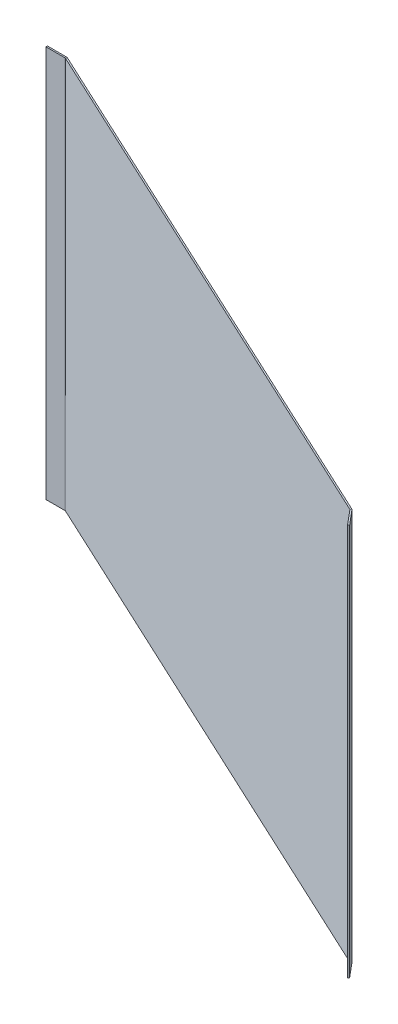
ISO-10303-21;
HEADER;
FILE_DESCRIPTION(('STEP AP214'),'2;1');
FILE_NAME('part.step','',(''),(''),'','','');
FILE_SCHEMA(('AUTOMOTIVE_DESIGN { 1 0 10303 214 1 1 1 1 }'));
ENDSEC;
DATA;
#1=APPLICATION_CONTEXT('core data for automotive mechanical design processes');
#2=APPLICATION_PROTOCOL_DEFINITION('international standard','automotive_design',2000,#1);
#3=PRODUCT_CONTEXT('',#1,'mechanical');
#4=PRODUCT('Part','Part','',(#3));
#5=PRODUCT_RELATED_PRODUCT_CATEGORY('part','',(#4));
#6=PRODUCT_DEFINITION_FORMATION('','',#4);
#7=PRODUCT_DEFINITION_CONTEXT('part definition',#1,'design');
#8=PRODUCT_DEFINITION('design','',#6,#7);
#9=PRODUCT_DEFINITION_SHAPE('','',#8);
#10=(LENGTH_UNIT() NAMED_UNIT(*) SI_UNIT(.MILLI.,.METRE.));
#11=(NAMED_UNIT(*) PLANE_ANGLE_UNIT() SI_UNIT($,.RADIAN.));
#12=(NAMED_UNIT(*) SI_UNIT($,.STERADIAN.) SOLID_ANGLE_UNIT());
#13=UNCERTAINTY_MEASURE_WITH_UNIT(LENGTH_MEASURE(1.E-05),#10,'distance_accuracy_value','');
#14=(GEOMETRIC_REPRESENTATION_CONTEXT(3) GLOBAL_UNCERTAINTY_ASSIGNED_CONTEXT((#13)) GLOBAL_UNIT_ASSIGNED_CONTEXT((#10,
#11,#12)) REPRESENTATION_CONTEXT('',''));
#15=CARTESIAN_POINT('',(0.,0.,0.));
#16=DIRECTION('',(0.,0.,1.));
#17=DIRECTION('',(1.,0.,0.));
#18=AXIS2_PLACEMENT_3D('',#15,#16,#17);
#19=CARTESIAN_POINT('',(4.56848885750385,800.,-16.5205923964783));
#20=DIRECTION('',(0.4226182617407,0.,-0.90630778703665));
#21=DIRECTION('',(-0.90630778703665,0.,-0.4226182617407));
#22=AXIS2_PLACEMENT_3D('',#19,#20,#21);
#23=PLANE('',#22);
#24=DIRECTION('',(-0.90630778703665,0.,-0.4226182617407));
#25=VECTOR('',#24,1.);
#26=CARTESIAN_POINT('',(4.56848885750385,800.,-16.5205923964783));
#27=LINE('',#26,#25);
#28=CARTESIAN_POINT('',(1128.39014478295,800.,507.52605216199));
#29=VERTEX_POINT('',#28);
#30=CARTESIAN_POINT('',(40.8208003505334,800.,0.384138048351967));
#31=VERTEX_POINT('',#30);
#32=EDGE_CURVE('E60',#29,#31,#27,.T.);
#33=ORIENTED_EDGE('',*,*,#32,.F.);
#34=DIRECTION('',(0.,-1.,0.));
#35=VECTOR('',#34,1.);
#36=CARTESIAN_POINT('',(1128.39014478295,800.,507.52605216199));
#37=LINE('',#36,#35);
#38=CARTESIAN_POINT('',(1128.39014478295,0.,507.52605216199));
#39=VERTEX_POINT('',#38);
#40=EDGE_CURVE('E52',#29,#39,#37,.T.);
#41=ORIENTED_EDGE('',*,*,#40,.T.);
#42=DIRECTION('',(0.90630778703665,0.,0.4226182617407));
#43=VECTOR('',#42,1.);
#44=CARTESIAN_POINT('',(4.56848885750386,0.,-16.5205923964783));
#45=LINE('',#44,#43);
#46=CARTESIAN_POINT('',(40.8208003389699,0.,0.384138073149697));
#47=VERTEX_POINT('',#46);
#48=EDGE_CURVE('E68',#47,#39,#45,.T.);
#49=ORIENTED_EDGE('',*,*,#48,.F.);
#50=DIRECTION('',(0.,-1.,0.));
#51=VECTOR('',#50,1.);
#52=CARTESIAN_POINT('',(40.8208003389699,800.,0.384138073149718));
#53=LINE('',#52,#51);
#54=EDGE_CURVE('E229',#31,#47,#53,.T.);
#55=ORIENTED_EDGE('',*,*,#54,.F.);
#56=EDGE_LOOP('',(#33,#41,#49,#55));
#57=FACE_BOUND('',#56,.T.);
#58=ADVANCED_FACE('F43',(#57),#23,.T.);
#59=CARTESIAN_POINT('',(3.30063407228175,800.,-13.8016690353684));
#60=DIRECTION('',(0.4226182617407,0.,-0.90630778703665));
#61=DIRECTION('',(-0.90630778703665,0.,-0.4226182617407));
#62=AXIS2_PLACEMENT_3D('',#59,#60,#61);
#63=PLANE('',#62);
#64=DIRECTION('',(0.,-1.,0.));
#65=VECTOR('',#64,1.);
#66=CARTESIAN_POINT('',(1127.12228999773,800.,510.2449755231));
#67=LINE('',#66,#65);
#68=CARTESIAN_POINT('',(1127.12229034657,800.,510.244974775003));
#69=VERTEX_POINT('',#68);
#70=CARTESIAN_POINT('',(1127.12228999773,0.,510.2449755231));
#71=VERTEX_POINT('',#70);
#72=EDGE_CURVE('E233',#69,#71,#67,.T.);
#73=ORIENTED_EDGE('',*,*,#72,.F.);
#74=DIRECTION('',(-0.90630778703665,0.,-0.4226182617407));
#75=VECTOR('',#74,1.);
#76=CARTESIAN_POINT('',(3.30063407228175,800.,-13.8016690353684));
#77=LINE('',#76,#75);
#78=CARTESIAN_POINT('',(39.5529455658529,800.,3.10306140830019));
#79=VERTEX_POINT('',#78);
#80=EDGE_CURVE('E47',#69,#79,#77,.T.);
#81=ORIENTED_EDGE('',*,*,#80,.T.);
#82=DIRECTION('',(0.,-1.,0.));
#83=VECTOR('',#82,1.);
#84=CARTESIAN_POINT('',(39.5529455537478,800.,3.10306143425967));
#85=LINE('',#84,#83);
#86=CARTESIAN_POINT('',(39.552945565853,0.,3.10306140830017));
#87=VERTEX_POINT('',#86);
#88=EDGE_CURVE('E223',#79,#87,#85,.T.);
#89=ORIENTED_EDGE('',*,*,#88,.T.);
#90=DIRECTION('',(0.90630778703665,0.,0.4226182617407));
#91=VECTOR('',#90,1.);
#92=CARTESIAN_POINT('',(3.30063407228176,0.,-13.8016690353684));
#93=LINE('',#92,#91);
#94=EDGE_CURVE('E241',#87,#71,#93,.T.);
#95=ORIENTED_EDGE('',*,*,#94,.T.);
#96=EDGE_LOOP('',(#73,#81,#89,#95));
#97=FACE_BOUND('',#96,.T.);
#98=ADVANCED_FACE('F246',(#97),#63,.F.);
#99=CARTESIAN_POINT('',(3.30063407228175,800.,-13.8016690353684));
#100=DIRECTION('',(0.,-1.,0.));
#101=DIRECTION('',(0.4226182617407,0.,-0.90630778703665));
#102=AXIS2_PLACEMENT_3D('',#99,#100,#101);
#103=PLANE('',#102);
#104=DIRECTION('',(-0.4226182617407,0.,0.90630778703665));
#105=VECTOR('',#104,1.);
#106=CARTESIAN_POINT('',(1127.12228999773,800.,510.2449755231));
#107=LINE('',#106,#105);
#108=EDGE_CURVE('E12',#29,#69,#107,.T.);
#109=ORIENTED_EDGE('',*,*,#108,.F.);
#110=ORIENTED_EDGE('',*,*,#32,.T.);
#111=DIRECTION('',(-0.4226182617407,0.,0.90630778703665));
#112=VECTOR('',#111,1.);
#113=CARTESIAN_POINT('',(39.5529455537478,800.,3.10306143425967));
#114=LINE('',#113,#112);
#115=EDGE_CURVE('E226',#31,#79,#114,.T.);
#116=ORIENTED_EDGE('',*,*,#115,.T.);
#117=ORIENTED_EDGE('',*,*,#80,.F.);
#118=EDGE_LOOP('',(#109,#110,#116,#117));
#119=FACE_BOUND('',#118,.T.);
#120=ADVANCED_FACE('F45',(#119),#103,.F.);
#121=CARTESIAN_POINT('',(3.30063407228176,0.,-13.8016690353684));
#122=DIRECTION('',(0.,1.,0.));
#123=DIRECTION('',(-0.4226182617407,0.,0.90630778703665));
#124=AXIS2_PLACEMENT_3D('',#121,#122,#123);
#125=PLANE('',#124);
#126=DIRECTION('',(0.4226182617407,0.,-0.90630778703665));
#127=VECTOR('',#126,1.);
#128=CARTESIAN_POINT('',(1127.12228999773,0.,510.2449755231));
#129=LINE('',#128,#127);
#130=EDGE_CURVE('E236',#71,#39,#129,.T.);
#131=ORIENTED_EDGE('',*,*,#130,.F.);
#132=ORIENTED_EDGE('',*,*,#94,.F.);
#133=DIRECTION('',(0.4226182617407,0.,-0.90630778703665));
#134=VECTOR('',#133,1.);
#135=CARTESIAN_POINT('',(39.5529455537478,0.,3.10306143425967));
#136=LINE('',#135,#134);
#137=EDGE_CURVE('E231',#87,#47,#136,.T.);
#138=ORIENTED_EDGE('',*,*,#137,.T.);
#139=ORIENTED_EDGE('',*,*,#48,.T.);
#140=EDGE_LOOP('',(#131,#132,#138,#139));
#141=FACE_BOUND('',#140,.T.);
#142=ADVANCED_FACE('F279',(#141),#125,.F.);
#143=CARTESIAN_POINT('',(0.,0.,3.));
#144=DIRECTION('',(1.,0.,0.));
#145=DIRECTION('',(0.,0.,-1.));
#146=AXIS2_PLACEMENT_3D('',#143,#144,#145);
#147=PLANE('',#146);
#148=DIRECTION('',(0.,-1.,0.));
#149=VECTOR('',#148,1.);
#150=CARTESIAN_POINT('',(0.,0.,0.));
#151=LINE('',#150,#149);
#152=CARTESIAN_POINT('',(0.,800.,0.));
#153=VERTEX_POINT('',#152);
#154=CARTESIAN_POINT('',(0.,0.,0.));
#155=VERTEX_POINT('',#154);
#156=EDGE_CURVE('E212',#153,#155,#151,.T.);
#157=ORIENTED_EDGE('',*,*,#156,.T.);
#158=DIRECTION('',(0.,0.,-1.));
#159=VECTOR('',#158,1.);
#160=CARTESIAN_POINT('',(0.,0.,3.));
#161=LINE('',#160,#159);
#162=CARTESIAN_POINT('',(0.,0.,3.));
#163=VERTEX_POINT('',#162);
#164=EDGE_CURVE('E194',#163,#155,#161,.T.);
#165=ORIENTED_EDGE('',*,*,#164,.F.);
#166=DIRECTION('',(0.,-1.,0.));
#167=VECTOR('',#166,1.);
#168=CARTESIAN_POINT('',(0.,0.,3.));
#169=LINE('',#168,#167);
#170=CARTESIAN_POINT('',(0.,800.,3.));
#171=VERTEX_POINT('',#170);
#172=EDGE_CURVE('E204',#171,#163,#169,.T.);
#173=ORIENTED_EDGE('',*,*,#172,.F.);
#174=DIRECTION('',(0.,0.,-1.));
#175=VECTOR('',#174,1.);
#176=CARTESIAN_POINT('',(0.,800.,3.));
#177=LINE('',#176,#175);
#178=EDGE_CURVE('E209',#171,#153,#177,.T.);
#179=ORIENTED_EDGE('',*,*,#178,.T.);
#180=EDGE_LOOP('',(#157,#165,#173,#179));
#181=FACE_BOUND('',#180,.T.);
#182=ADVANCED_FACE('F277',(#181),#147,.F.);
#183=CARTESIAN_POINT('',(0.,800.,3.));
#184=DIRECTION('',(0.,0.,-1.));
#185=DIRECTION('',(-1.,0.,0.));
#186=AXIS2_PLACEMENT_3D('',#183,#184,#185);
#187=PLANE('',#186);
#188=DIRECTION('',(0.,-1.,0.));
#189=VECTOR('',#188,1.);
#190=CARTESIAN_POINT('',(39.088065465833,800.,3.));
#191=LINE('',#190,#189);
#192=CARTESIAN_POINT('',(39.088065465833,800.,2.9999999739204));
#193=VERTEX_POINT('',#192);
#194=CARTESIAN_POINT('',(39.088065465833,0.,3.));
#195=VERTEX_POINT('',#194);
#196=EDGE_CURVE('E191',#193,#195,#191,.T.);
#197=ORIENTED_EDGE('',*,*,#196,.F.);
#198=DIRECTION('',(-1.,0.,0.));
#199=VECTOR('',#198,1.);
#200=CARTESIAN_POINT('',(0.,800.,3.));
#201=LINE('',#200,#199);
#202=EDGE_CURVE('E207',#193,#171,#201,.T.);
#203=ORIENTED_EDGE('',*,*,#202,.T.);
#204=ORIENTED_EDGE('',*,*,#172,.T.);
#205=DIRECTION('',(1.,0.,0.));
#206=VECTOR('',#205,1.);
#207=CARTESIAN_POINT('',(0.,0.,3.));
#208=LINE('',#207,#206);
#209=EDGE_CURVE('E202',#163,#195,#208,.T.);
#210=ORIENTED_EDGE('',*,*,#209,.T.);
#211=EDGE_LOOP('',(#197,#203,#204,#210));
#212=FACE_BOUND('',#211,.T.);
#213=ADVANCED_FACE('F270',(#212),#187,.F.);
#214=CARTESIAN_POINT('',(0.,800.,3.));
#215=DIRECTION('',(0.,-1.,0.));
#216=DIRECTION('',(0.,0.,-1.));
#217=AXIS2_PLACEMENT_3D('',#214,#215,#216);
#218=PLANE('',#217);
#219=DIRECTION('',(0.,0.,1.));
#220=VECTOR('',#219,1.);
#221=CARTESIAN_POINT('',(39.088065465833,800.,3.));
#222=LINE('',#221,#220);
#223=CARTESIAN_POINT('',(39.088065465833,800.,0.));
#224=VERTEX_POINT('',#223);
#225=EDGE_CURVE('E215',#224,#193,#222,.T.);
#226=ORIENTED_EDGE('',*,*,#225,.F.);
#227=DIRECTION('',(-1.,0.,0.));
#228=VECTOR('',#227,1.);
#229=CARTESIAN_POINT('',(0.,800.,0.));
#230=LINE('',#229,#228);
#231=EDGE_CURVE('E200',#224,#153,#230,.T.);
#232=ORIENTED_EDGE('',*,*,#231,.T.);
#233=ORIENTED_EDGE('',*,*,#178,.F.);
#234=ORIENTED_EDGE('',*,*,#202,.F.);
#235=EDGE_LOOP('',(#226,#232,#233,#234));
#236=FACE_BOUND('',#235,.T.);
#237=ADVANCED_FACE('F273',(#236),#218,.F.);
#238=CARTESIAN_POINT('',(0.,800.,0.));
#239=DIRECTION('',(0.,0.,-1.));
#240=DIRECTION('',(-1.,0.,0.));
#241=AXIS2_PLACEMENT_3D('',#238,#239,#240);
#242=PLANE('',#241);
#243=ORIENTED_EDGE('',*,*,#231,.F.);
#244=DIRECTION('',(0.,-1.,0.));
#245=VECTOR('',#244,1.);
#246=CARTESIAN_POINT('',(39.088065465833,800.,0.));
#247=LINE('',#246,#245);
#248=CARTESIAN_POINT('',(39.0880654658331,0.,0.));
#249=VERTEX_POINT('',#248);
#250=EDGE_CURVE('E197',#224,#249,#247,.T.);
#251=ORIENTED_EDGE('',*,*,#250,.T.);
#252=DIRECTION('',(1.,0.,0.));
#253=VECTOR('',#252,1.);
#254=CARTESIAN_POINT('',(0.,0.,0.));
#255=LINE('',#254,#253);
#256=EDGE_CURVE('E192',#155,#249,#255,.T.);
#257=ORIENTED_EDGE('',*,*,#256,.F.);
#258=ORIENTED_EDGE('',*,*,#156,.F.);
#259=EDGE_LOOP('',(#243,#251,#257,#258));
#260=FACE_BOUND('',#259,.T.);
#261=ADVANCED_FACE('F257',(#260),#242,.T.);
#262=CARTESIAN_POINT('',(0.,0.,3.));
#263=DIRECTION('',(0.,1.,0.));
#264=DIRECTION('',(0.,0.,1.));
#265=AXIS2_PLACEMENT_3D('',#262,#263,#264);
#266=PLANE('',#265);
#267=DIRECTION('',(0.,0.,-1.));
#268=VECTOR('',#267,1.);
#269=CARTESIAN_POINT('',(39.0880654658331,0.,3.));
#270=LINE('',#269,#268);
#271=EDGE_CURVE('E218',#195,#249,#270,.T.);
#272=ORIENTED_EDGE('',*,*,#271,.F.);
#273=ORIENTED_EDGE('',*,*,#209,.F.);
#274=ORIENTED_EDGE('',*,*,#164,.T.);
#275=ORIENTED_EDGE('',*,*,#256,.T.);
#276=EDGE_LOOP('',(#272,#273,#274,#275));
#277=FACE_BOUND('',#276,.T.);
#278=ADVANCED_FACE('F265',(#277),#266,.F.);
#279=CARTESIAN_POINT('',(39.088065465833,800.,4.10000002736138));
#280=DIRECTION('',(0.,-1.,0.));
#281=DIRECTION('',(0.,0.,-1.));
#282=AXIS2_PLACEMENT_3D('',#279,#280,#281);
#283=PLANE('',#282);
#284=ORIENTED_EDGE('',*,*,#115,.F.);
#285=CARTESIAN_POINT('',(39.088065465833,800.,4.1));
#286=DIRECTION('',(0.,1.,0.));
#287=DIRECTION('',(-1.,0.,0.));
#288=AXIS2_PLACEMENT_3D('',#285,#286,#287);
#289=CIRCLE('',#288,4.10000002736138);
#290=EDGE_CURVE('E179',#31,#224,#289,.T.);
#291=ORIENTED_EDGE('',*,*,#290,.T.);
#292=ORIENTED_EDGE('',*,*,#225,.T.);
#293=CARTESIAN_POINT('',(39.088065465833,800.,4.10000002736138));
#294=DIRECTION('',(0.,1.,0.));
#295=DIRECTION('',(0.,0.,1.));
#296=AXIS2_PLACEMENT_3D('',#293,#294,#295);
#297=CIRCLE('',#296,1.10000005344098);
#298=EDGE_CURVE('E183',#79,#193,#297,.T.);
#299=ORIENTED_EDGE('',*,*,#298,.F.);
#300=EDGE_LOOP('',(#284,#291,#292,#299));
#301=FACE_BOUND('',#300,.T.);
#302=ADVANCED_FACE('F251',(#301),#283,.F.);
#303=CARTESIAN_POINT('',(39.0880654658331,0.,4.10000002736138));
#304=DIRECTION('',(0.,1.,0.));
#305=DIRECTION('',(-1.,0.,0.));
#306=AXIS2_PLACEMENT_3D('',#303,#304,#305);
#307=PLANE('',#306);
#308=ORIENTED_EDGE('',*,*,#271,.T.);
#309=CARTESIAN_POINT('',(39.0880654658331,0.,4.1));
#310=DIRECTION('',(0.,1.,0.));
#311=DIRECTION('',(-1.,0.,0.));
#312=AXIS2_PLACEMENT_3D('',#309,#310,#311);
#313=CIRCLE('',#312,4.10000002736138);
#314=EDGE_CURVE('E180',#249,#47,#313,.F.);
#315=ORIENTED_EDGE('',*,*,#314,.T.);
#316=ORIENTED_EDGE('',*,*,#137,.F.);
#317=CARTESIAN_POINT('',(39.0880654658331,0.,4.10000002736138));
#318=DIRECTION('',(0.,-1.,0.));
#319=DIRECTION('',(1.,0.,0.));
#320=AXIS2_PLACEMENT_3D('',#317,#318,#319);
#321=CIRCLE('',#320,1.10000005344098);
#322=EDGE_CURVE('E188',#195,#87,#321,.T.);
#323=ORIENTED_EDGE('',*,*,#322,.F.);
#324=EDGE_LOOP('',(#308,#315,#316,#323));
#325=FACE_BOUND('',#324,.T.);
#326=ADVANCED_FACE('F263',(#325),#307,.F.);
#327=CARTESIAN_POINT('',(39.0880654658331,-400.006144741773,4.1));
#328=DIRECTION('',(0.,1.,0.));
#329=DIRECTION('',(-1.,0.,0.));
#330=AXIS2_PLACEMENT_3D('',#327,#328,#329);
#331=CYLINDRICAL_SURFACE('',#330,1.10000002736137);
#332=ORIENTED_EDGE('',*,*,#322,.T.);
#333=ORIENTED_EDGE('',*,*,#88,.F.);
#334=ORIENTED_EDGE('',*,*,#298,.T.);
#335=ORIENTED_EDGE('',*,*,#196,.T.);
#336=EDGE_LOOP('',(#332,#333,#334,#335));
#337=FACE_BOUND('',#336,.T.);
#338=ADVANCED_FACE('F268',(#337),#331,.F.);
#339=CARTESIAN_POINT('',(39.0880654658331,-400.006144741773,4.1));
#340=DIRECTION('',(0.,1.,0.));
#341=DIRECTION('',(-1.,0.,0.));
#342=AXIS2_PLACEMENT_3D('',#339,#340,#341);
#343=CYLINDRICAL_SURFACE('',#342,4.10000002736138);
#344=ORIENTED_EDGE('',*,*,#314,.F.);
#345=ORIENTED_EDGE('',*,*,#250,.F.);
#346=ORIENTED_EDGE('',*,*,#290,.F.);
#347=ORIENTED_EDGE('',*,*,#54,.T.);
#348=EDGE_LOOP('',(#344,#345,#346,#347));
#349=FACE_BOUND('',#348,.T.);
#350=ADVANCED_FACE('F255',(#349),#343,.T.);
#351=CARTESIAN_POINT('',(1126.65740954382,800.,511.241914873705));
#352=DIRECTION('',(0.,-1.,0.));
#353=DIRECTION('',(0.,0.,-1.));
#354=AXIS2_PLACEMENT_3D('',#351,#352,#353);
#355=PLANE('',#354);
#356=DIRECTION('',(-0.766044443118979,0.,0.642787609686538));
#357=VECTOR('',#356,1.);
#358=CARTESIAN_POINT('',(1127.50005879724,800.,510.534847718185));
#359=LINE('',#358,#357);
#360=CARTESIAN_POINT('',(1129.7981921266,800.,508.606484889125));
#361=VERTEX_POINT('',#360);
#362=CARTESIAN_POINT('',(1127.50005946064,800.,510.53484716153));
#363=VERTEX_POINT('',#362);
#364=EDGE_CURVE('E511',#361,#363,#359,.T.);
#365=ORIENTED_EDGE('',*,*,#364,.F.);
#366=CARTESIAN_POINT('',(1126.65740990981,800.,511.24191408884));
#367=DIRECTION('',(0.,1.,0.));
#368=DIRECTION('',(0.,0.,1.));
#369=AXIS2_PLACEMENT_3D('',#366,#367,#368);
#370=CIRCLE('',#369,4.10000086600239);
#371=EDGE_CURVE('E166',#361,#29,#370,.T.);
#372=ORIENTED_EDGE('',*,*,#371,.T.);
#373=ORIENTED_EDGE('',*,*,#108,.T.);
#374=CARTESIAN_POINT('',(1126.65740954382,800.,511.241914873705));
#375=DIRECTION('',(0.,1.,0.));
#376=DIRECTION('',(0.,0.,1.));
#377=AXIS2_PLACEMENT_3D('',#374,#375,#376);
#378=CIRCLE('',#377,1.10000169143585);
#379=EDGE_CURVE('E173',#363,#69,#378,.T.);
#380=ORIENTED_EDGE('',*,*,#379,.F.);
#381=EDGE_LOOP('',(#365,#372,#373,#380));
#382=FACE_BOUND('',#381,.T.);
#383=ADVANCED_FACE('F334',(#382),#355,.F.);
#384=CARTESIAN_POINT('',(1126.65740954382,0.,511.241914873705));
#385=DIRECTION('',(0.,1.,0.));
#386=DIRECTION('',(0.,0.,1.));
#387=AXIS2_PLACEMENT_3D('',#384,#385,#386);
#388=PLANE('',#387);
#389=CARTESIAN_POINT('',(1126.65740990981,0.,511.24191408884));
#390=DIRECTION('',(0.,1.,0.));
#391=DIRECTION('',(0.,0.,1.));
#392=AXIS2_PLACEMENT_3D('',#389,#390,#391);
#393=CIRCLE('',#392,4.10000086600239);
#394=CARTESIAN_POINT('',(1129.7981921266,0.,508.606484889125));
#395=VERTEX_POINT('',#394);
#396=EDGE_CURVE('E169',#39,#395,#393,.F.);
#397=ORIENTED_EDGE('',*,*,#396,.T.);
#398=DIRECTION('',(0.766044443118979,0.,-0.642787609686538));
#399=VECTOR('',#398,1.);
#400=CARTESIAN_POINT('',(1127.50005879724,0.,510.534847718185));
#401=LINE('',#400,#399);
#402=CARTESIAN_POINT('',(1127.50005879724,0.,510.534847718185));
#403=VERTEX_POINT('',#402);
#404=EDGE_CURVE('E144',#403,#395,#401,.T.);
#405=ORIENTED_EDGE('',*,*,#404,.F.);
#406=CARTESIAN_POINT('',(1126.65740954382,0.,511.241914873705));
#407=DIRECTION('',(0.,-1.,0.));
#408=DIRECTION('',(0.,0.,-1.));
#409=AXIS2_PLACEMENT_3D('',#406,#407,#408);
#410=CIRCLE('',#409,1.10000169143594);
#411=EDGE_CURVE('E176',#71,#403,#410,.T.);
#412=ORIENTED_EDGE('',*,*,#411,.F.);
#413=ORIENTED_EDGE('',*,*,#130,.T.);
#414=EDGE_LOOP('',(#397,#405,#412,#413));
#415=FACE_BOUND('',#414,.T.);
#416=ADVANCED_FACE('F341',(#415),#388,.F.);
#417=CARTESIAN_POINT('',(1126.65740990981,-400.008764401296,511.24191408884));
#418=DIRECTION('',(0.,1.,0.));
#419=DIRECTION('',(0.,0.,1.));
#420=AXIS2_PLACEMENT_3D('',#417,#418,#419);
#421=CYLINDRICAL_SURFACE('',#420,1.10000086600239);
#422=ORIENTED_EDGE('',*,*,#72,.T.);
#423=ORIENTED_EDGE('',*,*,#411,.T.);
#424=DIRECTION('',(0.,-1.,0.));
#425=VECTOR('',#424,1.);
#426=CARTESIAN_POINT('',(1127.50005879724,800.,510.534847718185));
#427=LINE('',#426,#425);
#428=EDGE_CURVE('E521',#363,#403,#427,.T.);
#429=ORIENTED_EDGE('',*,*,#428,.F.);
#430=ORIENTED_EDGE('',*,*,#379,.T.);
#431=EDGE_LOOP('',(#422,#423,#429,#430));
#432=FACE_BOUND('',#431,.T.);
#433=ADVANCED_FACE('F344',(#432),#421,.F.);
#434=CARTESIAN_POINT('',(1126.65740990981,-400.008764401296,511.24191408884));
#435=DIRECTION('',(0.,1.,0.));
#436=DIRECTION('',(0.,0.,1.));
#437=AXIS2_PLACEMENT_3D('',#434,#435,#436);
#438=CYLINDRICAL_SURFACE('',#437,4.10000086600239);
#439=ORIENTED_EDGE('',*,*,#40,.F.);
#440=ORIENTED_EDGE('',*,*,#371,.F.);
#441=DIRECTION('',(0.,-1.,0.));
#442=VECTOR('',#441,1.);
#443=CARTESIAN_POINT('',(1129.7981921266,800.,508.606484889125));
#444=LINE('',#443,#442);
#445=EDGE_CURVE('E161',#361,#395,#444,.T.);
#446=ORIENTED_EDGE('',*,*,#445,.T.);
#447=ORIENTED_EDGE('',*,*,#396,.F.);
#448=EDGE_LOOP('',(#439,#440,#446,#447));
#449=FACE_BOUND('',#448,.T.);
#450=ADVANCED_FACE('F352',(#449),#438,.T.);
#451=CARTESIAN_POINT('',(1152.6253829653,0.,540.478043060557));
#452=DIRECTION('',(-0.642787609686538,0.,-0.766044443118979));
#453=DIRECTION('',(-0.766044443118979,0.,0.642787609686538));
#454=AXIS2_PLACEMENT_3D('',#451,#452,#453);
#455=PLANE('',#454);
#456=DIRECTION('',(0.,1.,0.));
#457=VECTOR('',#456,1.);
#458=CARTESIAN_POINT('',(1154.92351629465,0.,538.549680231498));
#459=LINE('',#458,#457);
#460=CARTESIAN_POINT('',(1154.92351629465,0.,538.549680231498));
#461=VERTEX_POINT('',#460);
#462=CARTESIAN_POINT('',(1154.92351629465,800.,538.549680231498));
#463=VERTEX_POINT('',#462);
#464=EDGE_CURVE('E154',#461,#463,#459,.T.);
#465=ORIENTED_EDGE('',*,*,#464,.T.);
#466=DIRECTION('',(0.766044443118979,0.,-0.642787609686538));
#467=VECTOR('',#466,1.);
#468=CARTESIAN_POINT('',(1152.6253829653,800.,540.478043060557));
#469=LINE('',#468,#467);
#470=CARTESIAN_POINT('',(1152.6253829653,800.,540.478043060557));
#471=VERTEX_POINT('',#470);
#472=EDGE_CURVE('E170',#471,#463,#469,.T.);
#473=ORIENTED_EDGE('',*,*,#472,.F.);
#474=DIRECTION('',(0.,1.,0.));
#475=VECTOR('',#474,1.);
#476=CARTESIAN_POINT('',(1152.6253829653,0.,540.478043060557));
#477=LINE('',#476,#475);
#478=CARTESIAN_POINT('',(1152.6253829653,0.,540.478043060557));
#479=VERTEX_POINT('',#478);
#480=EDGE_CURVE('E156',#479,#471,#477,.T.);
#481=ORIENTED_EDGE('',*,*,#480,.F.);
#482=DIRECTION('',(0.766044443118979,0.,-0.642787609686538));
#483=VECTOR('',#482,1.);
#484=CARTESIAN_POINT('',(1152.6253829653,0.,540.478043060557));
#485=LINE('',#484,#483);
#486=EDGE_CURVE('E141',#479,#461,#485,.T.);
#487=ORIENTED_EDGE('',*,*,#486,.T.);
#488=EDGE_LOOP('',(#465,#473,#481,#487));
#489=FACE_BOUND('',#488,.T.);
#490=ADVANCED_FACE('F152',(#489),#455,.F.);
#491=CARTESIAN_POINT('',(329.857242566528,800.,-440.058844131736));
#492=DIRECTION('',(0.766044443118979,0.,-0.642787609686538));
#493=DIRECTION('',(-0.642787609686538,0.,-0.766044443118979));
#494=AXIS2_PLACEMENT_3D('',#491,#492,#493);
#495=PLANE('',#494);
#496=DIRECTION('',(-0.642787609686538,0.,-0.766044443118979));
#497=VECTOR('',#496,1.);
#498=CARTESIAN_POINT('',(329.857242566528,800.,-440.058844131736));
#499=LINE('',#498,#497);
#500=EDGE_CURVE('E157',#471,#363,#499,.T.);
#501=ORIENTED_EDGE('',*,*,#500,.T.);
#502=ORIENTED_EDGE('',*,*,#428,.T.);
#503=DIRECTION('',(0.642787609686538,0.,0.766044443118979));
#504=VECTOR('',#503,1.);
#505=CARTESIAN_POINT('',(329.857242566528,0.,-440.058844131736));
#506=LINE('',#505,#504);
#507=EDGE_CURVE('E522',#403,#479,#506,.T.);
#508=ORIENTED_EDGE('',*,*,#507,.T.);
#509=ORIENTED_EDGE('',*,*,#480,.T.);
#510=EDGE_LOOP('',(#501,#502,#508,#509));
#511=FACE_BOUND('',#510,.T.);
#512=ADVANCED_FACE('F372',(#511),#495,.F.);
#513=CARTESIAN_POINT('',(329.857242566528,0.,-440.058844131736));
#514=DIRECTION('',(0.,1.,0.));
#515=DIRECTION('',(-0.766044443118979,0.,0.642787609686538));
#516=AXIS2_PLACEMENT_3D('',#513,#514,#515);
#517=PLANE('',#516);
#518=ORIENTED_EDGE('',*,*,#507,.F.);
#519=ORIENTED_EDGE('',*,*,#404,.T.);
#520=DIRECTION('',(0.642787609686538,0.,0.766044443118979));
#521=VECTOR('',#520,1.);
#522=CARTESIAN_POINT('',(332.155375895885,0.,-441.987206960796));
#523=LINE('',#522,#521);
#524=EDGE_CURVE('E137',#395,#461,#523,.T.);
#525=ORIENTED_EDGE('',*,*,#524,.T.);
#526=ORIENTED_EDGE('',*,*,#486,.F.);
#527=EDGE_LOOP('',(#518,#519,#525,#526));
#528=FACE_BOUND('',#527,.T.);
#529=ADVANCED_FACE('F140',(#528),#517,.F.);
#530=CARTESIAN_POINT('',(332.155375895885,800.,-441.987206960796));
#531=DIRECTION('',(0.766044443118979,0.,-0.642787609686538));
#532=DIRECTION('',(-0.642787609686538,0.,-0.766044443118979));
#533=AXIS2_PLACEMENT_3D('',#530,#531,#532);
#534=PLANE('',#533);
#535=ORIENTED_EDGE('',*,*,#445,.F.);
#536=DIRECTION('',(-0.642787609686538,0.,-0.766044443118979));
#537=VECTOR('',#536,1.);
#538=CARTESIAN_POINT('',(332.155375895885,800.,-441.987206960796));
#539=LINE('',#538,#537);
#540=EDGE_CURVE('E149',#463,#361,#539,.T.);
#541=ORIENTED_EDGE('',*,*,#540,.F.);
#542=ORIENTED_EDGE('',*,*,#464,.F.);
#543=ORIENTED_EDGE('',*,*,#524,.F.);
#544=EDGE_LOOP('',(#535,#541,#542,#543));
#545=FACE_BOUND('',#544,.T.);
#546=ADVANCED_FACE('F160',(#545),#534,.T.);
#547=CARTESIAN_POINT('',(329.857242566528,800.,-440.058844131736));
#548=DIRECTION('',(0.,-1.,0.));
#549=DIRECTION('',(0.766044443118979,0.,-0.642787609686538));
#550=AXIS2_PLACEMENT_3D('',#547,#548,#549);
#551=PLANE('',#550);
#552=ORIENTED_EDGE('',*,*,#540,.T.);
#553=ORIENTED_EDGE('',*,*,#364,.T.);
#554=ORIENTED_EDGE('',*,*,#500,.F.);
#555=ORIENTED_EDGE('',*,*,#472,.T.);
#556=EDGE_LOOP('',(#552,#553,#554,#555));
#557=FACE_BOUND('',#556,.T.);
#558=ADVANCED_FACE('F392',(#557),#551,.F.);
#559=CLOSED_SHELL('',(#58,#98,#120,#142,#182,#213,#237,#261,#278,#302,#326,#338,#350,#383,#416,
#433,#450,#490,#512,#529,#546,#558));
#560=MANIFOLD_SOLID_BREP('B2',#559);
#561=ADVANCED_BREP_SHAPE_REPRESENTATION('',(#18,#560),#14);
#562=SHAPE_DEFINITION_REPRESENTATION(#9,#561);
ENDSEC;
END-ISO-10303-21;
